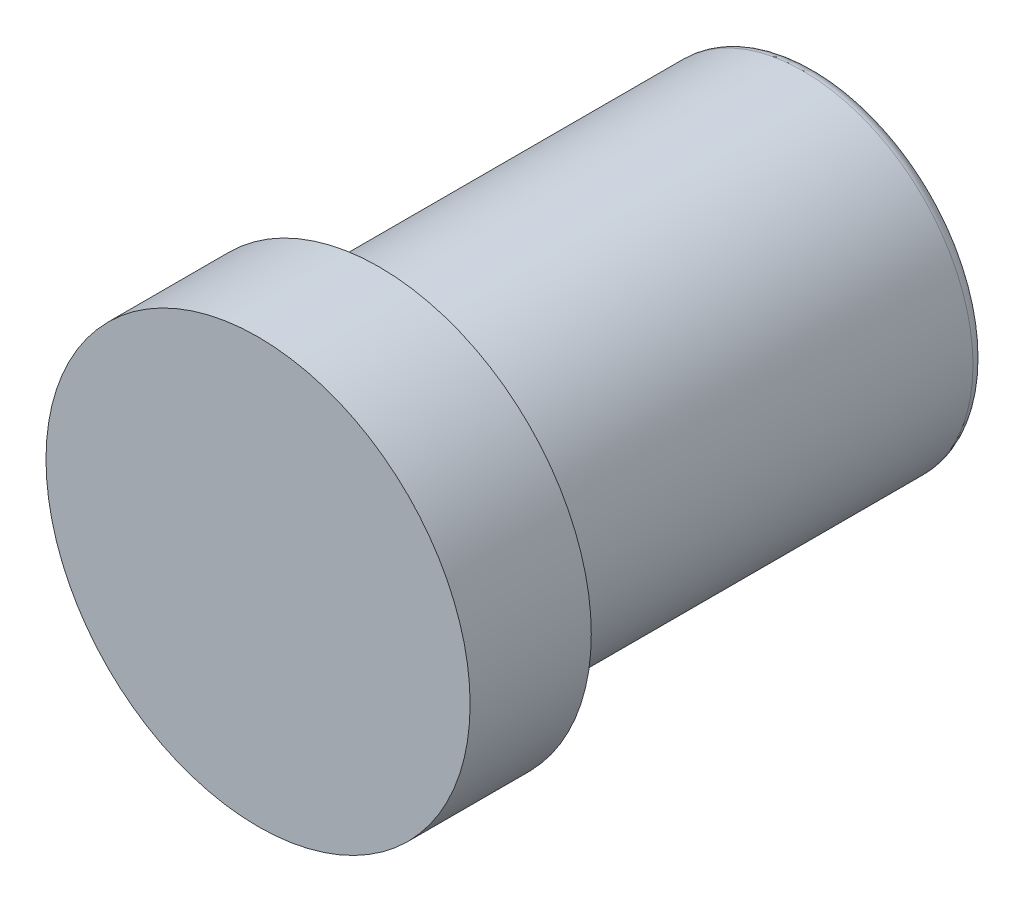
from build123d import *

# Parameters (mm, degrees)
M6_TAPPED_HOLE1_D           = 5
M6_TAPPED_HOLE1_DEPTH       = 8
M6_TAPPED_HOLE1_CSINK_D     = 6.05
M6_TAPPED_HOLE1_CSINK_ANGLE = 90
M6_TAPPED_HOLE1_TIP         = 1.502151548


with BuildPart() as part:
    # Sketch1 → Revolve1 (revolve)
    with BuildSketch(Plane(origin=(0, 0, 0), x_dir=(0, 0, -1), z_dir=(1, 0, 0)), mode=Mode.PRIVATE) as revolve1_sk:
        with BuildLine():
            Line((46, 0), (46, 13))
            ThreePointArc((46, 13), (45.707106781, 13.707106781), (45, 14))
            Line((45, 14), (10, 14))
            Line((10, 14), (10, 17.5))
            Line((10, 17.5), (0, 17.5))
            Line((0, 17.5), (0, 0))
            Line((0, 0), (46, 0))
        make_face()
    revolve(revolve1_sk.sketch.rotate(Axis((0, 0, 0), (0, 0, -1)), 90), axis=Axis((0, 0, 0), (0, 0, -1)))

    # M6 Tapped Hole1
    with Locations(Plane(origin=(0, 0, -46), x_dir=(-1, 0, 0), z_dir=(0, 0, -1))):
        with Locations((0, 0)):
            CounterSinkHole(M6_TAPPED_HOLE1_D / 2, M6_TAPPED_HOLE1_CSINK_D / 2, depth=M6_TAPPED_HOLE1_DEPTH, counter_sink_angle=M6_TAPPED_HOLE1_CSINK_ANGLE)
            with Locations((0, 0, -(M6_TAPPED_HOLE1_DEPTH + M6_TAPPED_HOLE1_TIP / 2))):  # 118° drill point
                Cone(0, M6_TAPPED_HOLE1_D / 2, M6_TAPPED_HOLE1_TIP, mode=Mode.SUBTRACT)


solid = part.part
